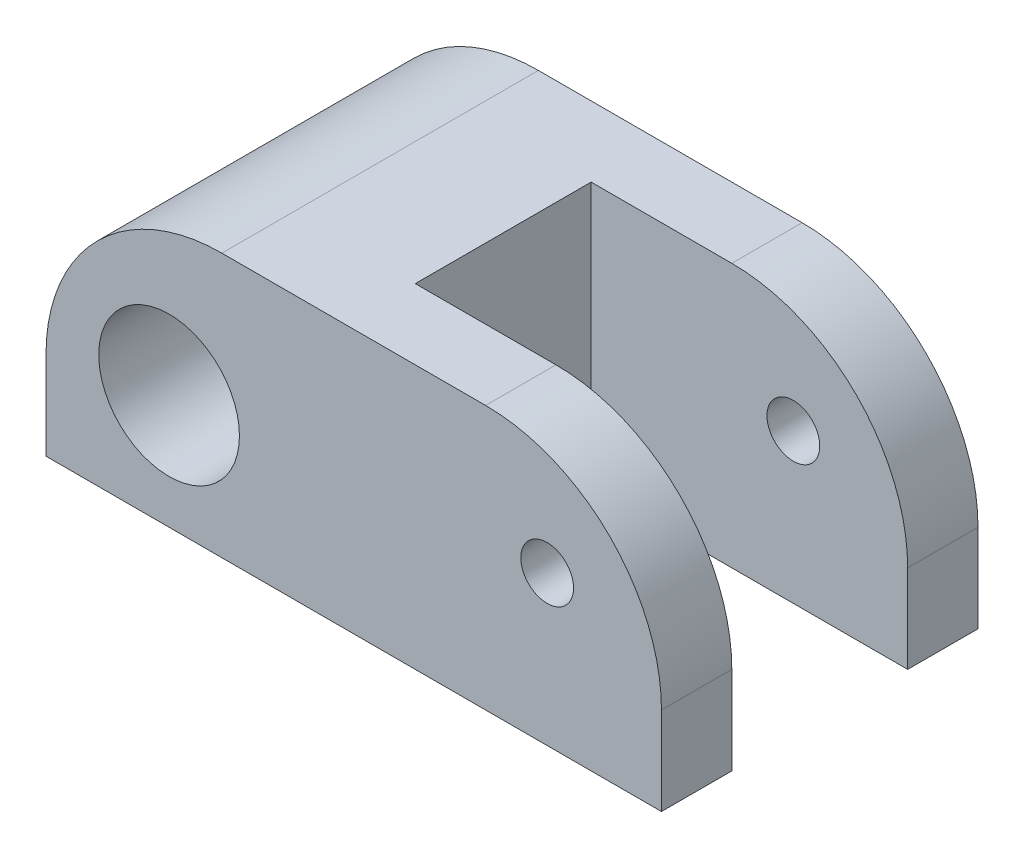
from build123d import *

# Parameters (mm, degrees)
CROQUIS1_W              = 35
CROQUIS1_H              = 15
CROQUIS1_R              = 4
CROQUIS1_R_2            = 1.5
SALIENTE_EXTRUIR1_DEPTH = 9
REDONDEO1_R             = 10
REDONDEO2_R             = 10
CROQUIS2_W              = 18
CROQUIS2_H              = 10
CORTAR_EXTRUIR1_DEPTH   = 18


with BuildPart() as part:
    # Croquis1 → Saliente-Extruir1 (new, symmetric)
    with BuildSketch(Plane.XY):
        with Locations((17.5, 7.5)):
            Rectangle(CROQUIS1_W, CROQUIS1_H)
        with Locations((7, 6.5)):
            Circle(CROQUIS1_R, mode=Mode.SUBTRACT)
        with Locations((28.5, 8.5)):
            Circle(CROQUIS1_R_2, mode=Mode.SUBTRACT)
    extrude(amount=SALIENTE_EXTRUIR1_DEPTH, both=True)

    # Redondeo1
    redondeo1_edges = [part.edges().sort_by_distance(p)[0] for p in [
        (0, 15, 0),
    ]]
    fillet(redondeo1_edges, radius=REDONDEO1_R)

    # Redondeo2
    redondeo2_edges = [part.edges().sort_by_distance(p)[0] for p in [
        (35, 15, 0),
    ]]
    fillet(redondeo2_edges, radius=REDONDEO2_R)

    # Croquis2 → Cortar-Extruir1 (cut)
    with BuildSketch(Plane(origin=(0, 15, 0), x_dir=(1, 0, 0), z_dir=(0, 1, 0))):
        with Locations((26, 0)):
            Rectangle(CROQUIS2_W, CROQUIS2_H)
    extrude(amount=-CORTAR_EXTRUIR1_DEPTH, mode=Mode.SUBTRACT)


solid = part.part
